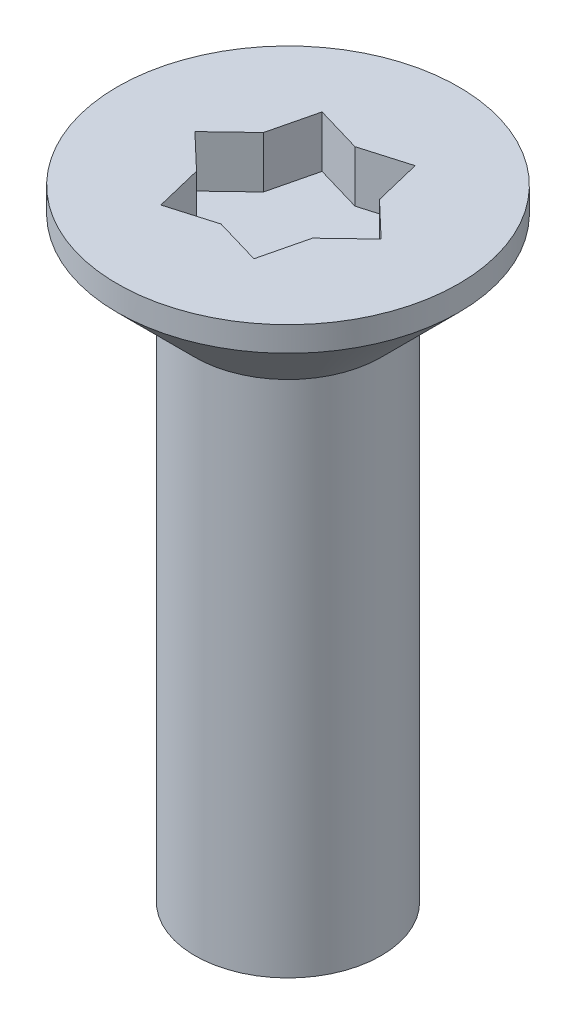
ISO-10303-21;
HEADER;
FILE_DESCRIPTION(('STEP AP214'),'2;1');
FILE_NAME('part.step','',(''),(''),'','','');
FILE_SCHEMA(('AUTOMOTIVE_DESIGN { 1 0 10303 214 1 1 1 1 }'));
ENDSEC;
DATA;
#1=APPLICATION_CONTEXT('core data for automotive mechanical design processes');
#2=APPLICATION_PROTOCOL_DEFINITION('international standard','automotive_design',2000,#1);
#3=PRODUCT_CONTEXT('',#1,'mechanical');
#4=PRODUCT('Part','Part','',(#3));
#5=PRODUCT_RELATED_PRODUCT_CATEGORY('part','',(#4));
#6=PRODUCT_DEFINITION_FORMATION('','',#4);
#7=PRODUCT_DEFINITION_CONTEXT('part definition',#1,'design');
#8=PRODUCT_DEFINITION('design','',#6,#7);
#9=PRODUCT_DEFINITION_SHAPE('','',#8);
#10=(LENGTH_UNIT() NAMED_UNIT(*) SI_UNIT(.MILLI.,.METRE.));
#11=(NAMED_UNIT(*) PLANE_ANGLE_UNIT() SI_UNIT($,.RADIAN.));
#12=(NAMED_UNIT(*) SI_UNIT($,.STERADIAN.) SOLID_ANGLE_UNIT());
#13=UNCERTAINTY_MEASURE_WITH_UNIT(LENGTH_MEASURE(1.E-05),#10,'distance_accuracy_value','');
#14=(GEOMETRIC_REPRESENTATION_CONTEXT(3) GLOBAL_UNCERTAINTY_ASSIGNED_CONTEXT((#13)) GLOBAL_UNIT_ASSIGNED_CONTEXT((#10,
#11,#12)) REPRESENTATION_CONTEXT('',''));
#15=CARTESIAN_POINT('',(0.,0.,0.));
#16=DIRECTION('',(0.,0.,1.));
#17=DIRECTION('',(1.,0.,0.));
#18=AXIS2_PLACEMENT_3D('',#15,#16,#17);
#19=CARTESIAN_POINT('',(0.750000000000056,9.17000000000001,1.29903810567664));
#20=DIRECTION('',(0.,1.,0.));
#21=DIRECTION('',(-1.,0.,0.));
#22=AXIS2_PLACEMENT_3D('',#19,#20,#21);
#23=PLANE('',#22);
#24=DIRECTION('',(0.236021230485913,0.,-0.971747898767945));
#25=VECTOR('',#24,1.);
#26=CARTESIAN_POINT('',(-0.934474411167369,9.17000000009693,-0.539519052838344));
#27=LINE('',#26,#25);
#28=CARTESIAN_POINT('',(-0.934474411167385,9.17000000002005,-0.539519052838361));
#29=VERTEX_POINT('',#28);
#30=CARTESIAN_POINT('',(-0.749999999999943,9.16999999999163,-1.29903810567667));
#31=VERTEX_POINT('',#30);
#32=EDGE_CURVE('E130',#29,#31,#27,.T.);
#33=ORIENTED_EDGE('',*,*,#32,.F.);
#34=DIRECTION('',(0.723547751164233,0.,-0.690274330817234));
#35=VECTOR('',#34,1.);
#36=CARTESIAN_POINT('',(-1.50000000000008,9.16999999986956,0.));
#37=LINE('',#36,#35);
#38=CARTESIAN_POINT('',(-1.50000000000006,9.16999999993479,0.));
#39=VERTEX_POINT('',#38);
#40=EDGE_CURVE('E136',#39,#29,#37,.T.);
#41=ORIENTED_EDGE('',*,*,#40,.F.);
#42=DIRECTION('',(-0.723547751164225,0.,-0.690274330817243));
#43=VECTOR('',#42,1.);
#44=CARTESIAN_POINT('',(-0.934474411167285,9.16999999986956,0.539519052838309));
#45=LINE('',#44,#43);
#46=CARTESIAN_POINT('',(-0.934474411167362,9.16999999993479,0.539519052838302));
#47=VERTEX_POINT('',#46);
#48=EDGE_CURVE('E142',#47,#39,#45,.T.);
#49=ORIENTED_EDGE('',*,*,#48,.F.);
#50=DIRECTION('',(-0.236021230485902,0.,-0.971747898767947));
#51=VECTOR('',#50,1.);
#52=CARTESIAN_POINT('',(-0.749999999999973,9.16999999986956,1.29903810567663));
#53=LINE('',#52,#51);
#54=CARTESIAN_POINT('',(-0.749999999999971,9.17000000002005,1.29903810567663));
#55=VERTEX_POINT('',#54);
#56=EDGE_CURVE('E148',#55,#47,#53,.T.);
#57=ORIENTED_EDGE('',*,*,#56,.F.);
#58=DIRECTION('',(-0.959568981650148,0.,0.2814735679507));
#59=VECTOR('',#58,1.);
#60=CARTESIAN_POINT('',(0.,9.17000000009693,1.07903810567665));
#61=LINE('',#60,#59);
#62=CARTESIAN_POINT('',(0.,9.17000000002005,1.07903810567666));
#63=VERTEX_POINT('',#62);
#64=EDGE_CURVE('E154',#63,#55,#61,.T.);
#65=ORIENTED_EDGE('',*,*,#64,.F.);
#66=DIRECTION('',(-0.959568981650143,0.,-0.281473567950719));
#67=VECTOR('',#66,1.);
#68=CARTESIAN_POINT('',(0.750000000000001,9.16999999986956,1.29903810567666));
#69=LINE('',#68,#67);
#70=CARTESIAN_POINT('',(0.750000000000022,9.17000000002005,1.29903810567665));
#71=VERTEX_POINT('',#70);
#72=EDGE_CURVE('E160',#71,#63,#69,.T.);
#73=ORIENTED_EDGE('',*,*,#72,.F.);
#74=DIRECTION('',(-0.236021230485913,0.,0.971747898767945));
#75=VECTOR('',#74,1.);
#76=CARTESIAN_POINT('',(0.934474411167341,9.17000000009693,0.539519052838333));
#77=LINE('',#76,#75);
#78=CARTESIAN_POINT('',(0.934474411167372,9.17000000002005,0.539519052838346));
#79=VERTEX_POINT('',#78);
#80=EDGE_CURVE('E166',#79,#71,#77,.T.);
#81=ORIENTED_EDGE('',*,*,#80,.F.);
#82=DIRECTION('',(-0.723547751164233,0.,0.690274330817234));
#83=VECTOR('',#82,1.);
#84=CARTESIAN_POINT('',(1.50000000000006,9.16999999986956,0.));
#85=LINE('',#84,#83);
#86=CARTESIAN_POINT('',(1.50000000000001,9.17000000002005,0.));
#87=VERTEX_POINT('',#86);
#88=EDGE_CURVE('E172',#87,#79,#85,.T.);
#89=ORIENTED_EDGE('',*,*,#88,.F.);
#90=DIRECTION('',(0.72354775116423,0.,0.690274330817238));
#91=VECTOR('',#90,1.);
#92=CARTESIAN_POINT('',(0.93447441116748,9.17000000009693,-0.539519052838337));
#93=LINE('',#92,#91);
#94=CARTESIAN_POINT('',(0.934474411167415,9.17000000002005,-0.539519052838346));
#95=VERTEX_POINT('',#94);
#96=EDGE_CURVE('E109',#95,#87,#93,.T.);
#97=ORIENTED_EDGE('',*,*,#96,.F.);
#98=DIRECTION('',(0.236021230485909,0.,0.971747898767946));
#99=VECTOR('',#98,1.);
#100=CARTESIAN_POINT('',(0.749999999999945,9.16999999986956,-1.29903810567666));
#101=LINE('',#100,#99);
#102=CARTESIAN_POINT('',(0.749999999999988,9.17000000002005,-1.29903810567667));
#103=VERTEX_POINT('',#102);
#104=EDGE_CURVE('E106',#103,#95,#101,.T.);
#105=ORIENTED_EDGE('',*,*,#104,.F.);
#106=DIRECTION('',(0.959568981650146,0.,-0.281473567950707));
#107=VECTOR('',#106,1.);
#108=CARTESIAN_POINT('',(0.,9.17000000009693,-1.07903810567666));
#109=LINE('',#108,#107);
#110=CARTESIAN_POINT('',(0.,9.16999999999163,-1.07903810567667));
#111=VERTEX_POINT('',#110);
#112=EDGE_CURVE('E103',#111,#103,#109,.T.);
#113=ORIENTED_EDGE('',*,*,#112,.F.);
#114=DIRECTION('',(0.959568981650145,0.,0.281473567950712));
#115=VECTOR('',#114,1.);
#116=CARTESIAN_POINT('',(-0.749999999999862,9.16999999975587,-1.29903810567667));
#117=LINE('',#116,#115);
#118=EDGE_CURVE('E120',#31,#111,#117,.T.);
#119=ORIENTED_EDGE('',*,*,#118,.F.);
#120=EDGE_LOOP('',(#33,#41,#49,#57,#65,#73,#81,#89,#97,#105,#113,#119));
#121=FACE_BOUND('',#120,.T.);
#122=ADVANCED_FACE('F17',(#121),#23,.T.);
#123=CARTESIAN_POINT('',(0.749999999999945,-500000.,-1.29903810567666));
#124=DIRECTION('',(-0.971747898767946,0.,0.236021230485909));
#125=DIRECTION('',(0.236021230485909,0.,0.971747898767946));
#126=AXIS2_PLACEMENT_3D('',#123,#124,#125);
#127=PLANE('',#126);
#128=DIRECTION('',(-0.23602123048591,0.,-0.971747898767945));
#129=VECTOR('',#128,1.);
#130=CARTESIAN_POINT('',(0.934474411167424,10.,-0.539519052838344));
#131=LINE('',#130,#129);
#132=CARTESIAN_POINT('',(0.9344744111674,10.0000000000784,-0.539519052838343));
#133=VERTEX_POINT('',#132);
#134=CARTESIAN_POINT('',(0.749999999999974,10.0000000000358,-1.29903810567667));
#135=VERTEX_POINT('',#134);
#136=EDGE_CURVE('E117',#133,#135,#131,.T.);
#137=ORIENTED_EDGE('',*,*,#136,.T.);
#138=DIRECTION('',(0.,1.,0.));
#139=VECTOR('',#138,1.);
#140=CARTESIAN_POINT('',(0.750000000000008,-500000.,-1.29903810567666));
#141=LINE('',#140,#139);
#142=EDGE_CURVE('E114',#103,#135,#141,.T.);
#143=ORIENTED_EDGE('',*,*,#142,.F.);
#144=ORIENTED_EDGE('',*,*,#104,.T.);
#145=DIRECTION('',(0.,1.,0.));
#146=VECTOR('',#145,1.);
#147=CARTESIAN_POINT('',(0.934474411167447,-500000.,-0.539519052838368));
#148=LINE('',#147,#146);
#149=EDGE_CURVE('E180',#133,#95,#148,.F.);
#150=ORIENTED_EDGE('',*,*,#149,.F.);
#151=EDGE_LOOP('',(#137,#143,#144,#150));
#152=FACE_BOUND('',#151,.T.);
#153=ADVANCED_FACE('F115',(#152),#127,.T.);
#154=CARTESIAN_POINT('',(0.,-500000.,-1.07903810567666));
#155=DIRECTION('',(0.281473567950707,0.,0.959568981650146));
#156=DIRECTION('',(0.959568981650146,0.,-0.281473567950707));
#157=AXIS2_PLACEMENT_3D('',#154,#155,#156);
#158=PLANE('',#157);
#159=DIRECTION('',(-0.959568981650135,0.,0.281473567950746));
#160=VECTOR('',#159,1.);
#161=CARTESIAN_POINT('',(0.750000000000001,10.,-1.29903810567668));
#162=LINE('',#161,#160);
#163=CARTESIAN_POINT('',(0.,10.0000000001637,-1.07903810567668));
#164=VERTEX_POINT('',#163);
#165=EDGE_CURVE('E183',#135,#164,#162,.T.);
#166=ORIENTED_EDGE('',*,*,#165,.T.);
#167=DIRECTION('',(0.,1.,0.));
#168=VECTOR('',#167,1.);
#169=CARTESIAN_POINT('',(0.,-500000.,-1.07903810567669));
#170=LINE('',#169,#168);
#171=EDGE_CURVE('E124',#111,#164,#170,.T.);
#172=ORIENTED_EDGE('',*,*,#171,.F.);
#173=ORIENTED_EDGE('',*,*,#112,.T.);
#174=ORIENTED_EDGE('',*,*,#142,.T.);
#175=EDGE_LOOP('',(#166,#172,#173,#174));
#176=FACE_BOUND('',#175,.T.);
#177=ADVANCED_FACE('F122',(#176),#158,.T.);
#178=CARTESIAN_POINT('',(-0.749999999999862,-500000.,-1.29903810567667));
#179=DIRECTION('',(-0.281473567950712,0.,0.959568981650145));
#180=DIRECTION('',(0.959568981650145,0.,0.281473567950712));
#181=AXIS2_PLACEMENT_3D('',#178,#179,#180);
#182=PLANE('',#181);
#183=DIRECTION('',(-0.959568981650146,0.,-0.281473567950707));
#184=VECTOR('',#183,1.);
#185=CARTESIAN_POINT('',(0.,10.,-1.07903810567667));
#186=LINE('',#185,#184);
#187=CARTESIAN_POINT('',(-0.749999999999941,10.0000000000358,-1.29903810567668));
#188=VERTEX_POINT('',#187);
#189=EDGE_CURVE('E185',#164,#188,#186,.T.);
#190=ORIENTED_EDGE('',*,*,#189,.T.);
#191=DIRECTION('',(0.,1.,0.));
#192=VECTOR('',#191,1.);
#193=CARTESIAN_POINT('',(-0.749999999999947,-500000.,-1.29903810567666));
#194=LINE('',#193,#192);
#195=EDGE_CURVE('E133',#31,#188,#194,.T.);
#196=ORIENTED_EDGE('',*,*,#195,.F.);
#197=ORIENTED_EDGE('',*,*,#118,.T.);
#198=ORIENTED_EDGE('',*,*,#171,.T.);
#199=EDGE_LOOP('',(#190,#196,#197,#198));
#200=FACE_BOUND('',#199,.T.);
#201=ADVANCED_FACE('F352',(#200),#182,.T.);
#202=CARTESIAN_POINT('',(-0.934474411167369,-500000.,-0.539519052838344));
#203=DIRECTION('',(0.971747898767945,0.,0.236021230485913));
#204=DIRECTION('',(0.236021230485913,0.,-0.971747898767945));
#205=AXIS2_PLACEMENT_3D('',#202,#203,#204);
#206=PLANE('',#205);
#207=DIRECTION('',(-0.236021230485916,0.,0.971747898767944));
#208=VECTOR('',#207,1.);
#209=CARTESIAN_POINT('',(-0.749999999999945,10.,-1.29903810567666));
#210=LINE('',#209,#208);
#211=CARTESIAN_POINT('',(-0.934474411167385,10.0000000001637,-0.539519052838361));
#212=VERTEX_POINT('',#211);
#213=EDGE_CURVE('E187',#188,#212,#210,.T.);
#214=ORIENTED_EDGE('',*,*,#213,.T.);
#215=DIRECTION('',(0.,1.,0.));
#216=VECTOR('',#215,1.);
#217=CARTESIAN_POINT('',(-0.934474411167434,-500000.,-0.539519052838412));
#218=LINE('',#217,#216);
#219=EDGE_CURVE('E139',#29,#212,#218,.T.);
#220=ORIENTED_EDGE('',*,*,#219,.F.);
#221=ORIENTED_EDGE('',*,*,#32,.T.);
#222=ORIENTED_EDGE('',*,*,#195,.T.);
#223=EDGE_LOOP('',(#214,#220,#221,#222));
#224=FACE_BOUND('',#223,.T.);
#225=ADVANCED_FACE('F342',(#224),#206,.T.);
#226=CARTESIAN_POINT('',(-1.50000000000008,-500000.,0.));
#227=DIRECTION('',(0.690274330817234,0.,0.723547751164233));
#228=DIRECTION('',(0.723547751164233,0.,-0.690274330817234));
#229=AXIS2_PLACEMENT_3D('',#226,#227,#228);
#230=PLANE('',#229);
#231=DIRECTION('',(-0.723547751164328,0.,0.690274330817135));
#232=VECTOR('',#231,1.);
#233=CARTESIAN_POINT('',(-0.934474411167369,10.,-0.539519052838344));
#234=LINE('',#233,#232);
#235=CARTESIAN_POINT('',(-1.50000000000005,9.99999999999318,0.));
#236=VERTEX_POINT('',#235);
#237=EDGE_CURVE('E189',#212,#236,#234,.T.);
#238=ORIENTED_EDGE('',*,*,#237,.T.);
#239=DIRECTION('',(0.,1.,0.));
#240=VECTOR('',#239,1.);
#241=CARTESIAN_POINT('',(-1.49999999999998,-500000.,-1.42789426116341E-13));
#242=LINE('',#241,#240);
#243=EDGE_CURVE('E145',#39,#236,#242,.T.);
#244=ORIENTED_EDGE('',*,*,#243,.F.);
#245=ORIENTED_EDGE('',*,*,#40,.T.);
#246=ORIENTED_EDGE('',*,*,#219,.T.);
#247=EDGE_LOOP('',(#238,#244,#245,#246));
#248=FACE_BOUND('',#247,.T.);
#249=ADVANCED_FACE('F332',(#248),#230,.T.);
#250=CARTESIAN_POINT('',(-0.934474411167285,-500000.,0.539519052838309));
#251=DIRECTION('',(0.690274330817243,0.,-0.723547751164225));
#252=DIRECTION('',(-0.723547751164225,0.,-0.690274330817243));
#253=AXIS2_PLACEMENT_3D('',#250,#251,#252);
#254=PLANE('',#253);
#255=DIRECTION('',(0.72354775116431,0.,0.690274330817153));
#256=VECTOR('',#255,1.);
#257=CARTESIAN_POINT('',(-1.50000000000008,10.,0.));
#258=LINE('',#257,#256);
#259=CARTESIAN_POINT('',(-0.934474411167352,9.99999999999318,0.53951905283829));
#260=VERTEX_POINT('',#259);
#261=EDGE_CURVE('E191',#236,#260,#258,.T.);
#262=ORIENTED_EDGE('',*,*,#261,.T.);
#263=DIRECTION('',(0.,1.,0.));
#264=VECTOR('',#263,1.);
#265=CARTESIAN_POINT('',(-0.934474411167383,-500000.,0.539519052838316));
#266=LINE('',#265,#264);
#267=EDGE_CURVE('E151',#47,#260,#266,.T.);
#268=ORIENTED_EDGE('',*,*,#267,.F.);
#269=ORIENTED_EDGE('',*,*,#48,.T.);
#270=ORIENTED_EDGE('',*,*,#243,.T.);
#271=EDGE_LOOP('',(#262,#268,#269,#270));
#272=FACE_BOUND('',#271,.T.);
#273=ADVANCED_FACE('F322',(#272),#254,.T.);
#274=CARTESIAN_POINT('',(-0.749999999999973,-500000.,1.29903810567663));
#275=DIRECTION('',(0.971747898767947,0.,-0.236021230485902));
#276=DIRECTION('',(-0.236021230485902,0.,-0.971747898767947));
#277=AXIS2_PLACEMENT_3D('',#274,#275,#276);
#278=PLANE('',#277);
#279=DIRECTION('',(0.236021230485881,0.,0.971747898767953));
#280=VECTOR('',#279,1.);
#281=CARTESIAN_POINT('',(-0.934474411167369,10.,0.539519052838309));
#282=LINE('',#281,#280);
#283=CARTESIAN_POINT('',(-0.749999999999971,10.0000000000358,1.29903810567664));
#284=VERTEX_POINT('',#283);
#285=EDGE_CURVE('E193',#260,#284,#282,.T.);
#286=ORIENTED_EDGE('',*,*,#285,.T.);
#287=DIRECTION('',(0.,1.,0.));
#288=VECTOR('',#287,1.);
#289=CARTESIAN_POINT('',(-0.749999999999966,-500000.,1.29903810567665));
#290=LINE('',#289,#288);
#291=EDGE_CURVE('E157',#55,#284,#290,.T.);
#292=ORIENTED_EDGE('',*,*,#291,.F.);
#293=ORIENTED_EDGE('',*,*,#56,.T.);
#294=ORIENTED_EDGE('',*,*,#267,.T.);
#295=EDGE_LOOP('',(#286,#292,#293,#294));
#296=FACE_BOUND('',#295,.T.);
#297=ADVANCED_FACE('F312',(#296),#278,.T.);
#298=CARTESIAN_POINT('',(0.,-500000.,1.07903810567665));
#299=DIRECTION('',(-0.2814735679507,0.,-0.959568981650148));
#300=DIRECTION('',(-0.959568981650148,0.,0.2814735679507));
#301=AXIS2_PLACEMENT_3D('',#298,#299,#300);
#302=PLANE('',#301);
#303=DIRECTION('',(0.95956898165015,0.,-0.281473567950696));
#304=VECTOR('',#303,1.);
#305=CARTESIAN_POINT('',(-0.749999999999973,10.,1.29903810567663));
#306=LINE('',#305,#304);
#307=CARTESIAN_POINT('',(0.,10.0000000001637,1.07903810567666));
#308=VERTEX_POINT('',#307);
#309=EDGE_CURVE('E195',#284,#308,#306,.T.);
#310=ORIENTED_EDGE('',*,*,#309,.T.);
#311=DIRECTION('',(0.,1.,0.));
#312=VECTOR('',#311,1.);
#313=CARTESIAN_POINT('',(0.,-500000.,1.07903810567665));
#314=LINE('',#313,#312);
#315=EDGE_CURVE('E163',#63,#308,#314,.T.);
#316=ORIENTED_EDGE('',*,*,#315,.F.);
#317=ORIENTED_EDGE('',*,*,#64,.T.);
#318=ORIENTED_EDGE('',*,*,#291,.T.);
#319=EDGE_LOOP('',(#310,#316,#317,#318));
#320=FACE_BOUND('',#319,.T.);
#321=ADVANCED_FACE('F302',(#320),#302,.T.);
#322=CARTESIAN_POINT('',(0.750000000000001,-500000.,1.29903810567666));
#323=DIRECTION('',(0.281473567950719,0.,-0.959568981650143));
#324=DIRECTION('',(-0.959568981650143,0.,-0.281473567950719));
#325=AXIS2_PLACEMENT_3D('',#322,#323,#324);
#326=PLANE('',#325);
#327=DIRECTION('',(0.959568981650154,0.,0.281473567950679));
#328=VECTOR('',#327,1.);
#329=CARTESIAN_POINT('',(0.,10.,1.07903810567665));
#330=LINE('',#329,#328);
#331=CARTESIAN_POINT('',(0.750000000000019,10.0000000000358,1.29903810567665));
#332=VERTEX_POINT('',#331);
#333=EDGE_CURVE('E197',#308,#332,#330,.T.);
#334=ORIENTED_EDGE('',*,*,#333,.T.);
#335=DIRECTION('',(0.,1.,0.));
#336=VECTOR('',#335,1.);
#337=CARTESIAN_POINT('',(0.749999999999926,-500000.,1.29903810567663));
#338=LINE('',#337,#336);
#339=EDGE_CURVE('E169',#71,#332,#338,.T.);
#340=ORIENTED_EDGE('',*,*,#339,.F.);
#341=ORIENTED_EDGE('',*,*,#72,.T.);
#342=ORIENTED_EDGE('',*,*,#315,.T.);
#343=EDGE_LOOP('',(#334,#340,#341,#342));
#344=FACE_BOUND('',#343,.T.);
#345=ADVANCED_FACE('F292',(#344),#326,.T.);
#346=CARTESIAN_POINT('',(0.934474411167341,-500000.,0.539519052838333));
#347=DIRECTION('',(-0.971747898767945,0.,-0.236021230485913));
#348=DIRECTION('',(-0.236021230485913,0.,0.971747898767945));
#349=AXIS2_PLACEMENT_3D('',#346,#347,#348);
#350=PLANE('',#349);
#351=DIRECTION('',(0.236021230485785,0.,-0.971747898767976));
#352=VECTOR('',#351,1.);
#353=CARTESIAN_POINT('',(0.750000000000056,10.,1.29903810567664));
#354=LINE('',#353,#352);
#355=CARTESIAN_POINT('',(0.934474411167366,10.0000000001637,0.539519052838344));
#356=VERTEX_POINT('',#355);
#357=EDGE_CURVE('E199',#332,#356,#354,.T.);
#358=ORIENTED_EDGE('',*,*,#357,.T.);
#359=DIRECTION('',(0.,1.,0.));
#360=VECTOR('',#359,1.);
#361=CARTESIAN_POINT('',(0.93447441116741,-500000.,0.53951905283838));
#362=LINE('',#361,#360);
#363=EDGE_CURVE('E175',#79,#356,#362,.T.);
#364=ORIENTED_EDGE('',*,*,#363,.F.);
#365=ORIENTED_EDGE('',*,*,#80,.T.);
#366=ORIENTED_EDGE('',*,*,#339,.T.);
#367=EDGE_LOOP('',(#358,#364,#365,#366));
#368=FACE_BOUND('',#367,.T.);
#369=ADVANCED_FACE('F283',(#368),#350,.T.);
#370=CARTESIAN_POINT('',(1.50000000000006,-500000.,0.));
#371=DIRECTION('',(-0.690274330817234,0.,-0.723547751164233));
#372=DIRECTION('',(-0.723547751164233,0.,0.690274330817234));
#373=AXIS2_PLACEMENT_3D('',#370,#371,#372);
#374=PLANE('',#373);
#375=DIRECTION('',(0.723547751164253,0.,-0.690274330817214));
#376=VECTOR('',#375,1.);
#377=CARTESIAN_POINT('',(0.934474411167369,10.,0.539519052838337));
#378=LINE('',#377,#376);
#379=CARTESIAN_POINT('',(1.50000000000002,10.00000000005,0.));
#380=VERTEX_POINT('',#379);
#381=EDGE_CURVE('E34',#356,#380,#378,.T.);
#382=ORIENTED_EDGE('',*,*,#381,.T.);
#383=DIRECTION('',(0.,1.,0.));
#384=VECTOR('',#383,1.);
#385=CARTESIAN_POINT('',(1.50000000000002,-500000.,0.));
#386=LINE('',#385,#384);
#387=EDGE_CURVE('E178',#87,#380,#386,.T.);
#388=ORIENTED_EDGE('',*,*,#387,.F.);
#389=ORIENTED_EDGE('',*,*,#88,.T.);
#390=ORIENTED_EDGE('',*,*,#363,.T.);
#391=EDGE_LOOP('',(#382,#388,#389,#390));
#392=FACE_BOUND('',#391,.T.);
#393=ADVANCED_FACE('F273',(#392),#374,.T.);
#394=CARTESIAN_POINT('',(0.93447441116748,-500000.,-0.539519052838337));
#395=DIRECTION('',(-0.690274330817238,0.,0.72354775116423));
#396=DIRECTION('',(0.72354775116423,0.,0.690274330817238));
#397=AXIS2_PLACEMENT_3D('',#394,#395,#396);
#398=PLANE('',#397);
#399=DIRECTION('',(-0.723547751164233,0.,-0.690274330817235));
#400=VECTOR('',#399,1.);
#401=CARTESIAN_POINT('',(1.5,10.,0.));
#402=LINE('',#401,#400);
#403=EDGE_CURVE('E202',#380,#133,#402,.T.);
#404=ORIENTED_EDGE('',*,*,#403,.T.);
#405=ORIENTED_EDGE('',*,*,#149,.T.);
#406=ORIENTED_EDGE('',*,*,#96,.T.);
#407=ORIENTED_EDGE('',*,*,#387,.T.);
#408=EDGE_LOOP('',(#404,#405,#406,#407));
#409=FACE_BOUND('',#408,.T.);
#410=ADVANCED_FACE('F263',(#409),#398,.T.);
#411=CARTESIAN_POINT('',(-2.74999999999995,10.,0.));
#412=DIRECTION('',(0.,-1.,0.));
#413=DIRECTION('',(1.,0.,0.));
#414=AXIS2_PLACEMENT_3D('',#411,#412,#413);
#415=PLANE('',#414);
#416=CARTESIAN_POINT('',(0.,10.,0.));
#417=DIRECTION('',(0.,-1.,0.));
#418=DIRECTION('',(1.,0.,0.));
#419=AXIS2_PLACEMENT_3D('',#416,#417,#418);
#420=CIRCLE('',#419,2.75);
#421=CARTESIAN_POINT('',(2.75,10.,0.));
#422=VERTEX_POINT('',#421);
#423=EDGE_CURVE('E20',#422,#422,#420,.T.);
#424=ORIENTED_EDGE('',*,*,#423,.F.);
#425=EDGE_LOOP('',(#424));
#426=FACE_BOUND('',#425,.T.);
#427=ORIENTED_EDGE('',*,*,#381,.F.);
#428=ORIENTED_EDGE('',*,*,#357,.F.);
#429=ORIENTED_EDGE('',*,*,#333,.F.);
#430=ORIENTED_EDGE('',*,*,#309,.F.);
#431=ORIENTED_EDGE('',*,*,#285,.F.);
#432=ORIENTED_EDGE('',*,*,#261,.F.);
#433=ORIENTED_EDGE('',*,*,#237,.F.);
#434=ORIENTED_EDGE('',*,*,#213,.F.);
#435=ORIENTED_EDGE('',*,*,#189,.F.);
#436=ORIENTED_EDGE('',*,*,#165,.F.);
#437=ORIENTED_EDGE('',*,*,#136,.F.);
#438=ORIENTED_EDGE('',*,*,#403,.F.);
#439=EDGE_LOOP('',(#427,#428,#429,#430,#431,#432,#433,#434,#435,#436,#437,#438));
#440=FACE_BOUND('',#439,.T.);
#441=ADVANCED_FACE('F226',(#426,#440),#415,.F.);
#442=CARTESIAN_POINT('',(0.,0.,0.));
#443=DIRECTION('',(0.,-1.,0.));
#444=DIRECTION('',(1.,0.,0.));
#445=AXIS2_PLACEMENT_3D('',#442,#443,#444);
#446=CYLINDRICAL_SURFACE('',#445,2.75);
#447=CARTESIAN_POINT('',(0.,9.59999999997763,0.));
#448=DIRECTION('',(0.,1.,0.));
#449=DIRECTION('',(0.,0.,1.));
#450=AXIS2_PLACEMENT_3D('',#447,#448,#449);
#451=CIRCLE('',#450,2.74999999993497);
#452=CARTESIAN_POINT('',(0.,9.59999999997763,2.74999999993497));
#453=VERTEX_POINT('',#452);
#454=EDGE_CURVE('E205',#453,#453,#451,.F.);
#455=ORIENTED_EDGE('',*,*,#454,.F.);
#456=EDGE_LOOP('',(#455));
#457=FACE_BOUND('',#456,.T.);
#458=ORIENTED_EDGE('',*,*,#423,.T.);
#459=EDGE_LOOP('',(#458));
#460=FACE_BOUND('',#459,.T.);
#461=ADVANCED_FACE('F216',(#457,#460),#446,.T.);
#462=CARTESIAN_POINT('',(0.,9.59999999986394,0.));
#463=DIRECTION('',(0.,1.,0.));
#464=DIRECTION('',(0.,0.,1.));
#465=AXIS2_PLACEMENT_3D('',#462,#463,#464);
#466=CONICAL_SURFACE('',#465,2.74999999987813,0.785398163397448);
#467=ORIENTED_EDGE('',*,*,#454,.T.);
#468=EDGE_LOOP('',(#467));
#469=FACE_BOUND('',#468,.T.);
#470=CARTESIAN_POINT('',(0.,8.35,0.));
#471=DIRECTION('',(0.,-1.,0.));
#472=DIRECTION('',(1.,0.,0.));
#473=AXIS2_PLACEMENT_3D('',#470,#471,#472);
#474=CIRCLE('',#473,1.5);
#475=CARTESIAN_POINT('',(1.5,8.35,0.));
#476=VERTEX_POINT('',#475);
#477=EDGE_CURVE('E26',#476,#476,#474,.T.);
#478=ORIENTED_EDGE('',*,*,#477,.F.);
#479=EDGE_LOOP('',(#478));
#480=FACE_BOUND('',#479,.T.);
#481=ADVANCED_FACE('F213',(#469,#480),#466,.T.);
#482=CARTESIAN_POINT('',(0.,0.,0.));
#483=DIRECTION('',(0.,1.,0.));
#484=DIRECTION('',(-1.,0.,0.));
#485=AXIS2_PLACEMENT_3D('',#482,#483,#484);
#486=PLANE('',#485);
#487=CARTESIAN_POINT('',(0.,0.,0.));
#488=DIRECTION('',(0.,-1.,0.));
#489=DIRECTION('',(1.,0.,0.));
#490=AXIS2_PLACEMENT_3D('',#487,#488,#489);
#491=CIRCLE('',#490,1.5);
#492=CARTESIAN_POINT('',(1.5,0.,0.));
#493=VERTEX_POINT('',#492);
#494=EDGE_CURVE('E11',#493,#493,#491,.F.);
#495=ORIENTED_EDGE('',*,*,#494,.F.);
#496=EDGE_LOOP('',(#495));
#497=FACE_BOUND('',#496,.T.);
#498=ADVANCED_FACE('F215',(#497),#486,.F.);
#499=CARTESIAN_POINT('',(0.,0.,0.));
#500=DIRECTION('',(0.,-1.,0.));
#501=DIRECTION('',(1.,0.,0.));
#502=AXIS2_PLACEMENT_3D('',#499,#500,#501);
#503=CYLINDRICAL_SURFACE('',#502,1.5);
#504=ORIENTED_EDGE('',*,*,#494,.T.);
#505=EDGE_LOOP('',(#504));
#506=FACE_BOUND('',#505,.T.);
#507=ORIENTED_EDGE('',*,*,#477,.T.);
#508=EDGE_LOOP('',(#507));
#509=FACE_BOUND('',#508,.T.);
#510=ADVANCED_FACE('F211',(#506,#509),#503,.T.);
#511=CLOSED_SHELL('',(#122,#153,#177,#201,#225,#249,#273,#297,#321,#345,#369,#393,#410,#441,
#461,#481,#498,#510));
#512=MANIFOLD_SOLID_BREP('B1',#511);
#513=ADVANCED_BREP_SHAPE_REPRESENTATION('',(#18,#512),#14);
#514=SHAPE_DEFINITION_REPRESENTATION(#9,#513);
ENDSEC;
END-ISO-10303-21;
